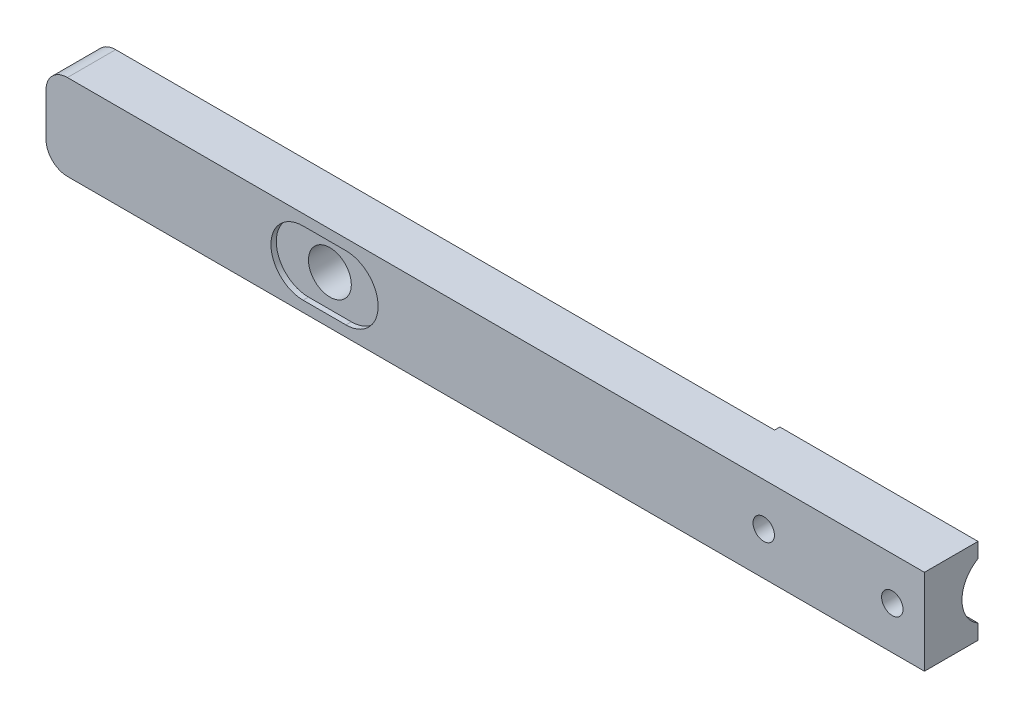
from build123d import *

# Parameters (mm, degrees)
SKETCH1_W           = 260.35
SKETCH1_H           = 25.4
SKETCH1_R           = 6.35
SKETCH1_R_2         = 3.175
BOSS_EXTRUDE1_DEPTH = 7.9375
FILLET1_R           = 6.35
SKETCH2_R           = 9.525
CUT_EXTRUDE1_DEPTH  = 57.15
SKETCH3_W           = 201.6252
SKETCH3_H           = 1.5748
CUT_EXTRUDE2_DEPTH  = 25.4
CUT_EXTRUDE3_START  = 6.35
CUT_EXTRUDE3_DEPTH  = 50.8


with BuildPart() as part:
    # Sketch1 → Boss-Extrude1 (new, symmetric)
    with BuildSketch(Plane.XY):
        with Locations((47.625, 0)):
            Rectangle(SKETCH1_W, SKETCH1_H)
        Circle(SKETCH1_R, mode=Mode.SUBTRACT)
        with Locations((168.275, 0)):
            Circle(SKETCH1_R_2, mode=Mode.SUBTRACT)
        with Locations((130.175, 0)):
            Circle(SKETCH1_R_2, mode=Mode.SUBTRACT)
    extrude(amount=BOSS_EXTRUDE1_DEPTH, both=True)

    # Fillet1
    fillet1_edges = [part.edges().sort_by_distance(p)[0] for p in [
        (-82.55, 12.7, 0),
        (-82.55, -12.7, 0),
    ]]
    fillet(fillet1_edges, radius=FILLET1_R)

    # Sketch2 → Cut-Extrude1 (cut)
    with BuildSketch(Plane(origin=(177.8, 0, 0), x_dir=(0, 0, -1), z_dir=(1, 0, 0))):
        with Locations((12.7, 0)):
            Circle(SKETCH2_R)
    extrude(amount=-CUT_EXTRUDE1_DEPTH, mode=Mode.SUBTRACT)

    # Sketch3 → Cut-Extrude2 (cut, symmetric)
    with BuildSketch(Plane(origin=(0, 0, 0), x_dir=(1, 0, 0), z_dir=(0, 1, 0))):
        with Locations((18.2626, 7.1501)):
            Rectangle(SKETCH3_W, SKETCH3_H)
    extrude(amount=CUT_EXTRUDE2_DEPTH, both=True, mode=Mode.SUBTRACT)

    # Sketch4 → Cut-Extrude3 (cut)
    with BuildSketch(Plane.XY.offset(CUT_EXTRUDE3_START)):
        with BuildLine():
            Line((-6.35, 9.525), (6.35, 9.525))
            ThreePointArc((6.35, 9.525), (15.875, 0), (6.35, -9.525))
            Line((6.35, -9.525), (-6.35, -9.525))
            ThreePointArc((-6.35, -9.525), (-15.875, 0), (-6.35, 9.525))
        make_face()
    extrude(amount=CUT_EXTRUDE3_DEPTH, mode=Mode.SUBTRACT)


solid = part.part
